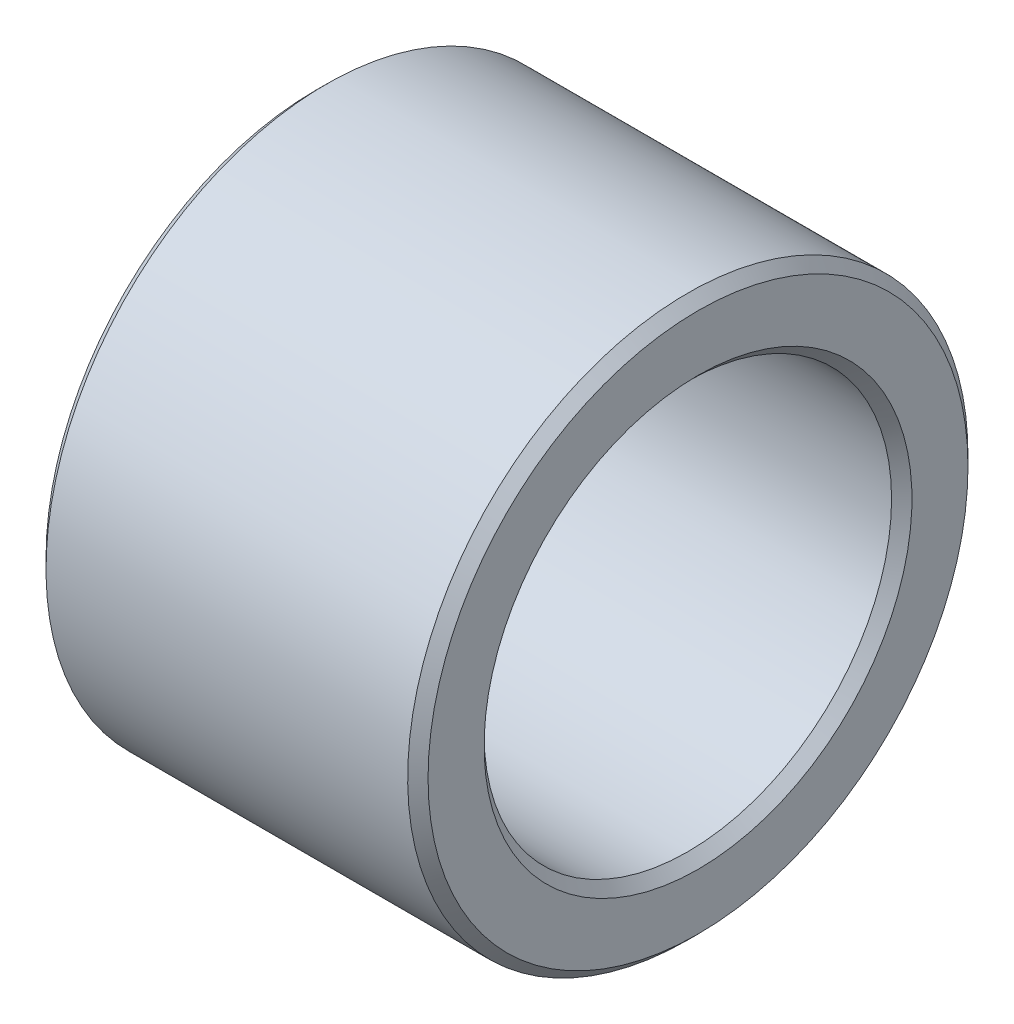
ISO-10303-21;
HEADER;
FILE_DESCRIPTION(('STEP AP214'),'2;1');
FILE_NAME('part.step','',(''),(''),'','','');
FILE_SCHEMA(('AUTOMOTIVE_DESIGN { 1 0 10303 214 1 1 1 1 }'));
ENDSEC;
DATA;
#1=APPLICATION_CONTEXT('core data for automotive mechanical design processes');
#2=APPLICATION_PROTOCOL_DEFINITION('international standard','automotive_design',2000,#1);
#3=PRODUCT_CONTEXT('',#1,'mechanical');
#4=PRODUCT('Part','Part','',(#3));
#5=PRODUCT_RELATED_PRODUCT_CATEGORY('part','',(#4));
#6=PRODUCT_DEFINITION_FORMATION('','',#4);
#7=PRODUCT_DEFINITION_CONTEXT('part definition',#1,'design');
#8=PRODUCT_DEFINITION('design','',#6,#7);
#9=PRODUCT_DEFINITION_SHAPE('','',#8);
#10=(LENGTH_UNIT() NAMED_UNIT(*) SI_UNIT(.MILLI.,.METRE.));
#11=(NAMED_UNIT(*) PLANE_ANGLE_UNIT() SI_UNIT($,.RADIAN.));
#12=(NAMED_UNIT(*) SI_UNIT($,.STERADIAN.) SOLID_ANGLE_UNIT());
#13=UNCERTAINTY_MEASURE_WITH_UNIT(LENGTH_MEASURE(1.E-05),#10,'distance_accuracy_value','');
#14=(GEOMETRIC_REPRESENTATION_CONTEXT(3) GLOBAL_UNCERTAINTY_ASSIGNED_CONTEXT((#13)) GLOBAL_UNIT_ASSIGNED_CONTEXT((#10,
#11,#12)) REPRESENTATION_CONTEXT('',''));
#15=CARTESIAN_POINT('',(0.,0.,0.));
#16=DIRECTION('',(0.,0.,1.));
#17=DIRECTION('',(1.,0.,0.));
#18=AXIS2_PLACEMENT_3D('',#15,#16,#17);
#19=CARTESIAN_POINT('',(0.,-9.5,0.));
#20=DIRECTION('',(-1.,0.,0.));
#21=DIRECTION('',(0.,1.,0.));
#22=AXIS2_PLACEMENT_3D('',#19,#20,#21);
#23=PLANE('',#22);
#24=CARTESIAN_POINT('',(0.,0.,0.));
#25=DIRECTION('',(1.,0.,0.));
#26=DIRECTION('',(0.,-1.,0.));
#27=AXIS2_PLACEMENT_3D('',#24,#25,#26);
#28=CIRCLE('',#27,8.4);
#29=CARTESIAN_POINT('',(0.,-8.4,0.));
#30=VERTEX_POINT('',#29);
#31=EDGE_CURVE('E9',#30,#30,#28,.T.);
#32=ORIENTED_EDGE('',*,*,#31,.T.);
#33=EDGE_LOOP('',(#32));
#34=FACE_BOUND('',#33,.T.);
#35=CARTESIAN_POINT('',(0.,0.,0.));
#36=DIRECTION('',(1.,0.,0.));
#37=DIRECTION('',(0.,-1.,0.));
#38=AXIS2_PLACEMENT_3D('',#35,#36,#37);
#39=CIRCLE('',#38,10.6);
#40=CARTESIAN_POINT('',(0.,-10.6,0.));
#41=VERTEX_POINT('',#40);
#42=EDGE_CURVE('E53',#41,#41,#39,.T.);
#43=ORIENTED_EDGE('',*,*,#42,.F.);
#44=EDGE_LOOP('',(#43));
#45=FACE_BOUND('',#44,.T.);
#46=ADVANCED_FACE('F15',(#34,#45),#23,.T.);
#47=CARTESIAN_POINT('',(0.2,0.,0.));
#48=DIRECTION('',(-1.,0.,0.));
#49=DIRECTION('',(0.,-1.,0.));
#50=AXIS2_PLACEMENT_3D('',#47,#48,#49);
#51=CONICAL_SURFACE('',#50,8.2,0.785398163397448);
#52=CARTESIAN_POINT('',(0.4,0.,0.));
#53=DIRECTION('',(1.,0.,0.));
#54=DIRECTION('',(0.,-1.,0.));
#55=AXIS2_PLACEMENT_3D('',#52,#53,#54);
#56=CIRCLE('',#55,8.);
#57=CARTESIAN_POINT('',(0.4,-8.,0.));
#58=VERTEX_POINT('',#57);
#59=EDGE_CURVE('E22',#58,#58,#56,.T.);
#60=ORIENTED_EDGE('',*,*,#59,.T.);
#61=EDGE_LOOP('',(#60));
#62=FACE_BOUND('',#61,.T.);
#63=ORIENTED_EDGE('',*,*,#31,.F.);
#64=EDGE_LOOP('',(#63));
#65=FACE_BOUND('',#64,.T.);
#66=ADVANCED_FACE('F82',(#62,#65),#51,.F.);
#67=CARTESIAN_POINT('',(7.5,0.,0.));
#68=DIRECTION('',(-1.,0.,0.));
#69=DIRECTION('',(0.,-1.,0.));
#70=AXIS2_PLACEMENT_3D('',#67,#68,#69);
#71=CYLINDRICAL_SURFACE('',#70,8.);
#72=CARTESIAN_POINT('',(14.6,0.,0.));
#73=DIRECTION('',(1.,0.,0.));
#74=DIRECTION('',(0.,-1.,0.));
#75=AXIS2_PLACEMENT_3D('',#72,#73,#74);
#76=CIRCLE('',#75,8.);
#77=CARTESIAN_POINT('',(14.6,-8.,0.));
#78=VERTEX_POINT('',#77);
#79=EDGE_CURVE('E58',#78,#78,#76,.T.);
#80=ORIENTED_EDGE('',*,*,#79,.T.);
#81=EDGE_LOOP('',(#80));
#82=FACE_BOUND('',#81,.T.);
#83=ORIENTED_EDGE('',*,*,#59,.F.);
#84=EDGE_LOOP('',(#83));
#85=FACE_BOUND('',#84,.T.);
#86=ADVANCED_FACE('F66',(#82,#85),#71,.F.);
#87=CARTESIAN_POINT('',(14.8,0.,0.));
#88=DIRECTION('',(1.,0.,0.));
#89=DIRECTION('',(0.,-1.,0.));
#90=AXIS2_PLACEMENT_3D('',#87,#88,#89);
#91=CONICAL_SURFACE('',#90,8.2,0.785398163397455);
#92=CARTESIAN_POINT('',(15.,0.,0.));
#93=DIRECTION('',(1.,0.,0.));
#94=DIRECTION('',(0.,-1.,0.));
#95=AXIS2_PLACEMENT_3D('',#92,#93,#94);
#96=CIRCLE('',#95,8.4);
#97=CARTESIAN_POINT('',(15.,-8.4,0.));
#98=VERTEX_POINT('',#97);
#99=EDGE_CURVE('E63',#98,#98,#96,.T.);
#100=ORIENTED_EDGE('',*,*,#99,.T.);
#101=EDGE_LOOP('',(#100));
#102=FACE_BOUND('',#101,.T.);
#103=ORIENTED_EDGE('',*,*,#79,.F.);
#104=EDGE_LOOP('',(#103));
#105=FACE_BOUND('',#104,.T.);
#106=ADVANCED_FACE('F69',(#102,#105),#91,.F.);
#107=CARTESIAN_POINT('',(15.,-9.5,0.));
#108=DIRECTION('',(1.,0.,0.));
#109=DIRECTION('',(0.,-1.,0.));
#110=AXIS2_PLACEMENT_3D('',#107,#108,#109);
#111=PLANE('',#110);
#112=CARTESIAN_POINT('',(15.,0.,0.));
#113=DIRECTION('',(1.,0.,0.));
#114=DIRECTION('',(0.,-1.,0.));
#115=AXIS2_PLACEMENT_3D('',#112,#113,#114);
#116=CIRCLE('',#115,10.6);
#117=CARTESIAN_POINT('',(15.,-10.6,0.));
#118=VERTEX_POINT('',#117);
#119=EDGE_CURVE('E61',#118,#118,#116,.T.);
#120=ORIENTED_EDGE('',*,*,#119,.T.);
#121=EDGE_LOOP('',(#120));
#122=FACE_BOUND('',#121,.T.);
#123=ORIENTED_EDGE('',*,*,#99,.F.);
#124=EDGE_LOOP('',(#123));
#125=FACE_BOUND('',#124,.T.);
#126=ADVANCED_FACE('F71',(#122,#125),#111,.T.);
#127=CARTESIAN_POINT('',(14.8,0.,0.));
#128=DIRECTION('',(-1.,0.,0.));
#129=DIRECTION('',(0.,-1.,0.));
#130=AXIS2_PLACEMENT_3D('',#127,#128,#129);
#131=CONICAL_SURFACE('',#130,10.8,0.785398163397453);
#132=CARTESIAN_POINT('',(14.6,0.,0.));
#133=DIRECTION('',(1.,0.,0.));
#134=DIRECTION('',(0.,-1.,0.));
#135=AXIS2_PLACEMENT_3D('',#132,#133,#134);
#136=CIRCLE('',#135,11.);
#137=CARTESIAN_POINT('',(14.6,-11.,0.));
#138=VERTEX_POINT('',#137);
#139=EDGE_CURVE('E55',#138,#138,#136,.T.);
#140=ORIENTED_EDGE('',*,*,#139,.T.);
#141=EDGE_LOOP('',(#140));
#142=FACE_BOUND('',#141,.T.);
#143=ORIENTED_EDGE('',*,*,#119,.F.);
#144=EDGE_LOOP('',(#143));
#145=FACE_BOUND('',#144,.T.);
#146=ADVANCED_FACE('F79',(#142,#145),#131,.T.);
#147=CARTESIAN_POINT('',(7.5,0.,0.));
#148=DIRECTION('',(-1.,0.,0.));
#149=DIRECTION('',(0.,-1.,0.));
#150=AXIS2_PLACEMENT_3D('',#147,#148,#149);
#151=CYLINDRICAL_SURFACE('',#150,11.);
#152=CARTESIAN_POINT('',(0.4,0.,0.));
#153=DIRECTION('',(1.,0.,0.));
#154=DIRECTION('',(0.,-1.,0.));
#155=AXIS2_PLACEMENT_3D('',#152,#153,#154);
#156=CIRCLE('',#155,11.);
#157=CARTESIAN_POINT('',(0.4,-11.,0.));
#158=VERTEX_POINT('',#157);
#159=EDGE_CURVE('E49',#158,#158,#156,.T.);
#160=ORIENTED_EDGE('',*,*,#159,.T.);
#161=EDGE_LOOP('',(#160));
#162=FACE_BOUND('',#161,.T.);
#163=ORIENTED_EDGE('',*,*,#139,.F.);
#164=EDGE_LOOP('',(#163));
#165=FACE_BOUND('',#164,.T.);
#166=ADVANCED_FACE('F50',(#162,#165),#151,.T.);
#167=CARTESIAN_POINT('',(0.2,0.,0.));
#168=DIRECTION('',(1.,0.,0.));
#169=DIRECTION('',(0.,-1.,0.));
#170=AXIS2_PLACEMENT_3D('',#167,#168,#169);
#171=CONICAL_SURFACE('',#170,10.8,0.785398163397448);
#172=ORIENTED_EDGE('',*,*,#42,.T.);
#173=EDGE_LOOP('',(#172));
#174=FACE_BOUND('',#173,.T.);
#175=ORIENTED_EDGE('',*,*,#159,.F.);
#176=EDGE_LOOP('',(#175));
#177=FACE_BOUND('',#176,.T.);
#178=ADVANCED_FACE('F92',(#174,#177),#171,.T.);
#179=CLOSED_SHELL('',(#46,#66,#86,#106,#126,#146,#166,#178));
#180=MANIFOLD_SOLID_BREP('B1',#179);
#181=ADVANCED_BREP_SHAPE_REPRESENTATION('',(#18,#180),#14);
#182=SHAPE_DEFINITION_REPRESENTATION(#9,#181);
ENDSEC;
END-ISO-10303-21;
